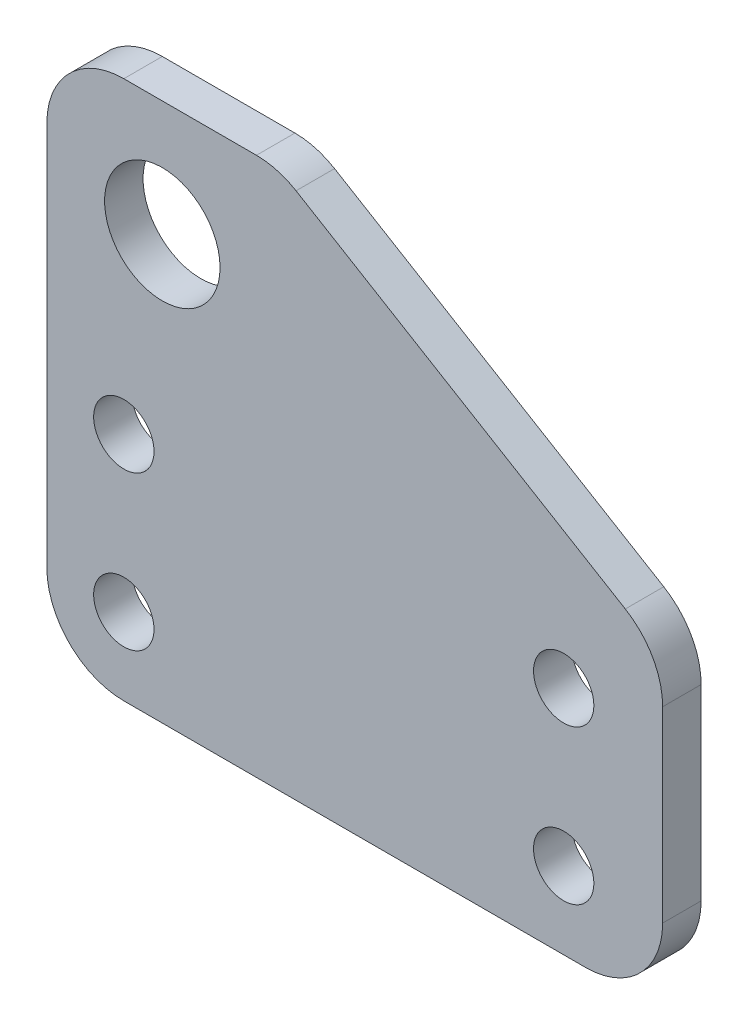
from build123d import *

# Parameters (mm, degrees)
SKETCH1_R           = 2.4892
SKETCH1_R_2         = 4.7625
BOSS_EXTRUDE1_DEPTH = 3.175
FILLET1_R           = 6.35


with BuildPart() as part:
    # Sketch1 → Boss-Extrude1 (new body)
    with BuildSketch(Plane.XY):
        Polygon((50.8, 0), (0, 0), (0, 44.45), (19.05, 44.45), (50.8, 25.4), align=None)
        with Locations((6.35, 19.05)):
            Circle(SKETCH1_R, mode=Mode.SUBTRACT)
        with Locations((42.635714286, 19.05)):
            Circle(SKETCH1_R, mode=Mode.SUBTRACT)
        with Locations((42.635714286, 6.35)):
            Circle(SKETCH1_R, mode=Mode.SUBTRACT)
        with Locations((6.35, 6.35)):
            Circle(SKETCH1_R, mode=Mode.SUBTRACT)
        with Locations((9.525, 34.925)):
            Circle(SKETCH1_R_2, mode=Mode.SUBTRACT)
    extrude(amount=BOSS_EXTRUDE1_DEPTH)

    # Fillet1
    fillet1_edges = [part.edges().sort_by_distance(p)[0] for p in [
        (50.8, 0, 1.5875),
        (0, 0, 1.5875),
        (0, 44.45, 1.5875),
        (19.05, 44.45, 1.5875),
        (50.8, 25.4, 1.5875),
    ]]
    fillet(fillet1_edges, radius=FILLET1_R)


solid = part.part
